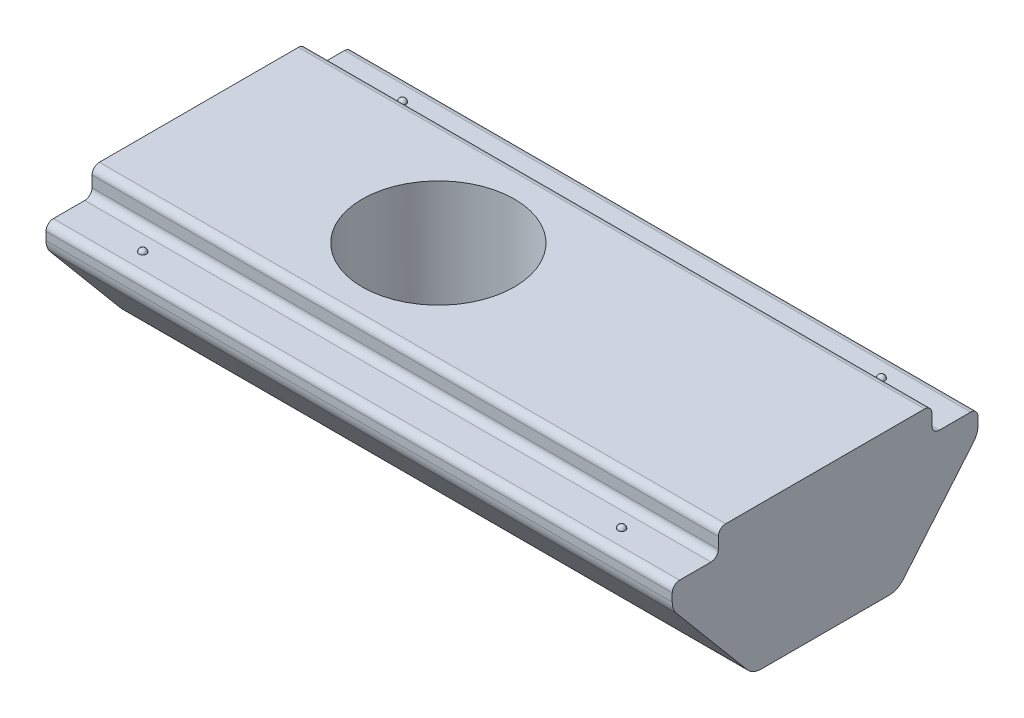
ISO-10303-21;
HEADER;
FILE_DESCRIPTION(('STEP AP214'),'2;1');
FILE_NAME('part.step','',(''),(''),'','','');
FILE_SCHEMA(('AUTOMOTIVE_DESIGN { 1 0 10303 214 1 1 1 1 }'));
ENDSEC;
DATA;
#1=APPLICATION_CONTEXT('core data for automotive mechanical design processes');
#2=APPLICATION_PROTOCOL_DEFINITION('international standard','automotive_design',2000,#1);
#3=PRODUCT_CONTEXT('',#1,'mechanical');
#4=PRODUCT('Part','Part','',(#3));
#5=PRODUCT_RELATED_PRODUCT_CATEGORY('part','',(#4));
#6=PRODUCT_DEFINITION_FORMATION('','',#4);
#7=PRODUCT_DEFINITION_CONTEXT('part definition',#1,'design');
#8=PRODUCT_DEFINITION('design','',#6,#7);
#9=PRODUCT_DEFINITION_SHAPE('','',#8);
#10=(LENGTH_UNIT() NAMED_UNIT(*) SI_UNIT(.MILLI.,.METRE.));
#11=(NAMED_UNIT(*) PLANE_ANGLE_UNIT() SI_UNIT($,.RADIAN.));
#12=(NAMED_UNIT(*) SI_UNIT($,.STERADIAN.) SOLID_ANGLE_UNIT());
#13=UNCERTAINTY_MEASURE_WITH_UNIT(LENGTH_MEASURE(1.E-05),#10,'distance_accuracy_value','');
#14=(GEOMETRIC_REPRESENTATION_CONTEXT(3) GLOBAL_UNCERTAINTY_ASSIGNED_CONTEXT((#13)) GLOBAL_UNIT_ASSIGNED_CONTEXT((#10,
#11,#12)) REPRESENTATION_CONTEXT('',''));
#15=CARTESIAN_POINT('',(0.,0.,0.));
#16=DIRECTION('',(0.,0.,1.));
#17=DIRECTION('',(1.,0.,0.));
#18=AXIS2_PLACEMENT_3D('',#15,#16,#17);
#19=CARTESIAN_POINT('',(10.5,-3.2,1.96834095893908));
#20=DIRECTION('',(0.,1.,0.));
#21=DIRECTION('',(0.,0.,1.));
#22=AXIS2_PLACEMENT_3D('',#19,#20,#21);
#23=PLANE('',#22);
#24=DIRECTION('',(-1.,0.,0.));
#25=VECTOR('',#24,1.);
#26=CARTESIAN_POINT('',(10.5,-3.2,1.73518712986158));
#27=LINE('',#26,#25);
#28=CARTESIAN_POINT('',(6.27278727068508,-3.2,1.73518712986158));
#29=VERTEX_POINT('',#28);
#30=CARTESIAN_POINT('',(1.12321619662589,-3.2,1.73518712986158));
#31=VERTEX_POINT('',#30);
#32=EDGE_CURVE('E230',#29,#31,#27,.T.);
#33=ORIENTED_EDGE('',*,*,#32,.T.);
#34=CARTESIAN_POINT('',(0.,-3.2,0.));
#35=DIRECTION('',(0.,1.,0.));
#36=DIRECTION('',(0.,0.,1.));
#37=AXIS2_PLACEMENT_3D('',#34,#35,#36);
#38=CIRCLE('',#37,2.067);
#39=CARTESIAN_POINT('',(1.12321619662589,-3.2,-1.73518712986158));
#40=VERTEX_POINT('',#39);
#41=EDGE_CURVE('E54',#31,#40,#38,.T.);
#42=ORIENTED_EDGE('',*,*,#41,.T.);
#43=DIRECTION('',(-1.,0.,0.));
#44=VECTOR('',#43,1.);
#45=CARTESIAN_POINT('',(10.5,-3.2,-1.73518712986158));
#46=LINE('',#45,#44);
#47=CARTESIAN_POINT('',(6.27278727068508,-3.2,-1.73518712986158));
#48=VERTEX_POINT('',#47);
#49=EDGE_CURVE('E78',#40,#48,#46,.F.);
#50=ORIENTED_EDGE('',*,*,#49,.T.);
#51=CARTESIAN_POINT('',(6.5,-3.2,0.));
#52=DIRECTION('',(0.,1.,0.));
#53=DIRECTION('',(0.,0.,1.));
#54=AXIS2_PLACEMENT_3D('',#51,#52,#53);
#55=CIRCLE('',#54,1.75);
#56=EDGE_CURVE('E378',#48,#29,#55,.T.);
#57=ORIENTED_EDGE('',*,*,#56,.T.);
#58=EDGE_LOOP('',(#33,#42,#50,#57));
#59=FACE_BOUND('',#58,.T.);
#60=ADVANCED_FACE('F34',(#59),#23,.F.);
#61=CARTESIAN_POINT('',(-6.5,-3.2,-1.73518712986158));
#62=VERTEX_POINT('',#61);
#63=CARTESIAN_POINT('',(-1.12321619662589,-3.2,-1.73518712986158));
#64=VERTEX_POINT('',#63);
#65=EDGE_CURVE('E234',#62,#64,#46,.F.);
#66=ORIENTED_EDGE('',*,*,#65,.T.);
#67=CARTESIAN_POINT('',(-1.12321619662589,-3.2,1.73518712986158));
#68=VERTEX_POINT('',#67);
#69=EDGE_CURVE('E400',#64,#68,#38,.T.);
#70=ORIENTED_EDGE('',*,*,#69,.T.);
#71=CARTESIAN_POINT('',(-6.5,-3.2,1.73518712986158));
#72=VERTEX_POINT('',#71);
#73=EDGE_CURVE('E232',#68,#72,#27,.T.);
#74=ORIENTED_EDGE('',*,*,#73,.T.);
#75=DIRECTION('',(0.,0.,-1.));
#76=VECTOR('',#75,1.);
#77=CARTESIAN_POINT('',(-6.5,-3.2,1.96834095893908));
#78=LINE('',#77,#76);
#79=EDGE_CURVE('E350',#72,#62,#78,.T.);
#80=ORIENTED_EDGE('',*,*,#79,.T.);
#81=EDGE_LOOP('',(#66,#70,#74,#80));
#82=FACE_BOUND('',#81,.T.);
#83=ADVANCED_FACE('F456',(#82),#23,.F.);
#84=CARTESIAN_POINT('',(6.72721272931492,-3.2,1.73518712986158));
#85=VERTEX_POINT('',#84);
#86=CARTESIAN_POINT('',(6.72721272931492,-3.2,-1.73518712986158));
#87=VERTEX_POINT('',#86);
#88=EDGE_CURVE('E63',#85,#87,#55,.T.);
#89=ORIENTED_EDGE('',*,*,#88,.T.);
#90=CARTESIAN_POINT('',(10.5,-3.2,-1.73518712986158));
#91=VERTEX_POINT('',#90);
#92=EDGE_CURVE('E226',#87,#91,#46,.F.);
#93=ORIENTED_EDGE('',*,*,#92,.T.);
#94=DIRECTION('',(0.,0.,-1.));
#95=VECTOR('',#94,1.);
#96=CARTESIAN_POINT('',(10.5,-3.2,1.96834095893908));
#97=LINE('',#96,#95);
#98=CARTESIAN_POINT('',(10.5,-3.2,1.73518712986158));
#99=VERTEX_POINT('',#98);
#100=EDGE_CURVE('E211',#99,#91,#97,.T.);
#101=ORIENTED_EDGE('',*,*,#100,.F.);
#102=EDGE_CURVE('E224',#99,#85,#27,.T.);
#103=ORIENTED_EDGE('',*,*,#102,.T.);
#104=EDGE_LOOP('',(#89,#93,#101,#103));
#105=FACE_BOUND('',#104,.T.);
#106=ADVANCED_FACE('F223',(#105),#23,.F.);
#107=CARTESIAN_POINT('',(10.5,-2.7,-1.73518712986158));
#108=DIRECTION('',(-1.,0.,0.));
#109=DIRECTION('',(0.,0.,1.));
#110=AXIS2_PLACEMENT_3D('',#107,#108,#109);
#111=CYLINDRICAL_SURFACE('',#110,0.5);
#112=CARTESIAN_POINT('',(-1.12321619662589,-3.2,-1.73518712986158));
#113=CARTESIAN_POINT('',(-1.08769534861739,-3.19997959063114,-1.75818499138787));
#114=CARTESIAN_POINT('',(-1.05150737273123,-3.19841594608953,-1.78005784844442));
#115=CARTESIAN_POINT('',(-0.978056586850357,-3.19294935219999,-1.82144547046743));
#116=CARTESIAN_POINT('',(-0.940795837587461,-3.18905063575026,-1.84096442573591));
#117=CARTESIAN_POINT('',(-0.865132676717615,-3.17963116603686,-1.87771521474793));
#118=CARTESIAN_POINT('',(-0.826725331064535,-3.17410207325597,-1.89493461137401));
#119=CARTESIAN_POINT('',(-0.749055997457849,-3.16207862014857,-1.92695879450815));
#120=CARTESIAN_POINT('',(-0.709793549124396,-3.15558372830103,-1.94176224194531));
#121=CARTESIAN_POINT('',(-0.579128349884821,-3.13361926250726,-1.98654275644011));
#122=CARTESIAN_POINT('',(-0.485988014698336,-3.1174100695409,-2.01137196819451));
#123=CARTESIAN_POINT('',(-0.344114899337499,-3.09748613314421,-2.03871928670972));
#124=CARTESIAN_POINT('',(-0.296590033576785,-3.09158617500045,-2.04617896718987));
#125=CARTESIAN_POINT('',(-0.200917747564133,-3.08209086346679,-2.05777546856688));
#126=CARTESIAN_POINT('',(-0.152770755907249,-3.07849400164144,-2.06191446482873));
#127=CARTESIAN_POINT('',(-0.0503369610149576,-3.07396696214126,-2.06709713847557));
#128=CARTESIAN_POINT('',(0.00398999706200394,-3.0734107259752,-2.06770729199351));
#129=CARTESIAN_POINT('',(0.112431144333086,-3.07610538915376,-2.06465306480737));
#130=CARTESIAN_POINT('',(0.166545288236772,-3.07935705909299,-2.06098781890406));
#131=CARTESIAN_POINT('',(0.27445295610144,-3.08898741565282,-2.04942295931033));
#132=CARTESIAN_POINT('',(0.328240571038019,-3.09539059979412,-2.04149012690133));
#133=CARTESIAN_POINT('',(0.434781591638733,-3.11010689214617,-2.02148331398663));
#134=CARTESIAN_POINT('',(0.487534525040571,-3.11842085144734,-2.00940748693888));
#135=CARTESIAN_POINT('',(0.591294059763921,-3.13551659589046,-1.98134246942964));
#136=CARTESIAN_POINT('',(0.642313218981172,-3.14429251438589,-1.96539594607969));
#137=CARTESIAN_POINT('',(0.743032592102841,-3.16109163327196,-1.9295717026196));
#138=CARTESIAN_POINT('',(0.792733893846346,-3.16911546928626,-1.90969734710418));
#139=CARTESIAN_POINT('',(0.890201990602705,-3.18305719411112,-1.86623740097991));
#140=CARTESIAN_POINT('',(0.937983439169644,-3.1889959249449,-1.8426921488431));
#141=CARTESIAN_POINT('',(1.03193471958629,-3.19744832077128,-1.79177872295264));
#142=CARTESIAN_POINT('',(1.07809968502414,-3.19995238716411,-1.76440007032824));
#143=CARTESIAN_POINT('',(1.12321619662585,-3.20000000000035,-1.73518712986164));
#144=B_SPLINE_CURVE_WITH_KNOTS('',3,(#112,#113,#114,#115,#116,#117,#118,#119,#120,#121,#122,
#123,#124,#125,#126,#127,#128,#129,#130,#131,#132,#133,#134,#135,#136,#137,#138,#139,#140,#141,
#142,#143),.UNSPECIFIED.,.F.,.F.,(4,2,2,2,2,2,2,2,2,2,2,2,2,2,2,4),(0.,0.126826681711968,
0.253424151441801,0.3806807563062,0.508007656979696,0.800068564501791,0.945343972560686,
1.09052413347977,1.25321406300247,1.41593692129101,1.57994513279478,1.74402653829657,
1.90637542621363,2.06858584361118,2.22912532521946,2.39011254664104),.UNSPECIFIED.);
#145=EDGE_CURVE('E394',#64,#40,#144,.T.);
#146=ORIENTED_EDGE('',*,*,#145,.F.);
#147=ORIENTED_EDGE('',*,*,#65,.F.);
#148=CARTESIAN_POINT('',(-6.5,-2.7,-1.73518712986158));
#149=DIRECTION('',(1.,0.,0.));
#150=DIRECTION('',(0.,0.,-1.));
#151=AXIS2_PLACEMENT_3D('',#148,#149,#150);
#152=CIRCLE('',#151,0.5);
#153=CARTESIAN_POINT('',(-6.5,-3.02139380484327,-2.11820935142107));
#154=VERTEX_POINT('',#153);
#155=EDGE_CURVE('E267',#154,#62,#152,.F.);
#156=ORIENTED_EDGE('',*,*,#155,.F.);
#157=DIRECTION('',(-1.,0.,0.));
#158=VECTOR('',#157,1.);
#159=CARTESIAN_POINT('',(10.5,-3.02139380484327,-2.11820935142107));
#160=LINE('',#159,#158);
#161=CARTESIAN_POINT('',(10.5,-3.02139380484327,-2.11820935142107));
#162=VERTEX_POINT('',#161);
#163=EDGE_CURVE('E260',#162,#154,#160,.T.);
#164=ORIENTED_EDGE('',*,*,#163,.F.);
#165=CARTESIAN_POINT('',(10.5,-2.7,-1.73518712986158));
#166=DIRECTION('',(1.,0.,0.));
#167=DIRECTION('',(0.,0.,-1.));
#168=AXIS2_PLACEMENT_3D('',#165,#166,#167);
#169=CIRCLE('',#168,0.5);
#170=EDGE_CURVE('E218',#91,#162,#169,.T.);
#171=ORIENTED_EDGE('',*,*,#170,.F.);
#172=ORIENTED_EDGE('',*,*,#92,.F.);
#173=CARTESIAN_POINT('',(6.72721272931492,-3.2,-1.73518712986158));
#174=CARTESIAN_POINT('',(6.68947863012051,-3.19998176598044,-1.74012995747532));
#175=CARTESIAN_POINT('',(6.65158311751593,-3.19992670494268,-1.74383840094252));
#176=CARTESIAN_POINT('',(6.57579128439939,-3.19982610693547,-1.7487682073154));
#177=CARTESIAN_POINT('',(6.53789564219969,-3.19978053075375,-1.75));
#178=CARTESIAN_POINT('',(6.46210435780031,-3.19978053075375,-1.75));
#179=CARTESIAN_POINT('',(6.42420871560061,-3.19982610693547,-1.7487682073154));
#180=CARTESIAN_POINT('',(6.34841688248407,-3.19992670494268,-1.74383840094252));
#181=CARTESIAN_POINT('',(6.31052136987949,-3.19998176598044,-1.74012995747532));
#182=CARTESIAN_POINT('',(6.27278727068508,-3.2,-1.73518712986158));
#183=B_SPLINE_CURVE_WITH_KNOTS('',3,(#173,#174,#175,#176,#177,#178,#179,#180,#181,#182),
.UNSPECIFIED.,.F.,.F.,(4,2,2,2,4),(0.,0.114148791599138,0.227815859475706,0.341482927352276,
0.455631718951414),.UNSPECIFIED.);
#184=EDGE_CURVE('E357',#87,#48,#183,.T.);
#185=ORIENTED_EDGE('',*,*,#184,.T.);
#186=ORIENTED_EDGE('',*,*,#49,.F.);
#187=EDGE_LOOP('',(#146,#147,#156,#164,#171,#172,#185,#186));
#188=FACE_BOUND('',#187,.T.);
#189=ADVANCED_FACE('F402',(#188),#111,.T.);
#190=CARTESIAN_POINT('',(10.5,-2.7,1.73518712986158));
#191=DIRECTION('',(-1.,0.,0.));
#192=DIRECTION('',(0.,0.,1.));
#193=AXIS2_PLACEMENT_3D('',#190,#191,#192);
#194=CYLINDRICAL_SURFACE('',#193,0.5);
#195=CARTESIAN_POINT('',(1.12321619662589,-3.2,1.73518712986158));
#196=CARTESIAN_POINT('',(1.08769534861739,-3.19997959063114,1.75818499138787));
#197=CARTESIAN_POINT('',(1.05150737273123,-3.19841594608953,1.78005784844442));
#198=CARTESIAN_POINT('',(0.978056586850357,-3.19294935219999,1.82144547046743));
#199=CARTESIAN_POINT('',(0.94079583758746,-3.18905063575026,1.84096442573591));
#200=CARTESIAN_POINT('',(0.865132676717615,-3.17963116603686,1.87771521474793));
#201=CARTESIAN_POINT('',(0.826725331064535,-3.17410207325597,1.89493461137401));
#202=CARTESIAN_POINT('',(0.749055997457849,-3.16207862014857,1.92695879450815));
#203=CARTESIAN_POINT('',(0.709793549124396,-3.15558372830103,1.94176224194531));
#204=CARTESIAN_POINT('',(0.57912834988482,-3.13361926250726,1.98654275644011));
#205=CARTESIAN_POINT('',(0.485988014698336,-3.1174100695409,2.01137196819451));
#206=CARTESIAN_POINT('',(0.344114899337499,-3.09748613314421,2.03871928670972));
#207=CARTESIAN_POINT('',(0.296590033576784,-3.09158617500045,2.04617896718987));
#208=CARTESIAN_POINT('',(0.200917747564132,-3.08209086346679,2.05777546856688));
#209=CARTESIAN_POINT('',(0.152770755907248,-3.07849400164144,2.06191446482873));
#210=CARTESIAN_POINT('',(0.0503369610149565,-3.07396696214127,2.06709713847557));
#211=CARTESIAN_POINT('',(-0.00398999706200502,-3.0734107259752,2.06770729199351));
#212=CARTESIAN_POINT('',(-0.112431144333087,-3.07610538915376,2.06465306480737));
#213=CARTESIAN_POINT('',(-0.166545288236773,-3.07935705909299,2.06098781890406));
#214=CARTESIAN_POINT('',(-0.274452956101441,-3.08898741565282,2.04942295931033));
#215=CARTESIAN_POINT('',(-0.32824057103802,-3.09539059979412,2.04149012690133));
#216=CARTESIAN_POINT('',(-0.434781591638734,-3.11010689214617,2.02148331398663));
#217=CARTESIAN_POINT('',(-0.487534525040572,-3.11842085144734,2.00940748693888));
#218=CARTESIAN_POINT('',(-0.591294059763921,-3.13551659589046,1.98134246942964));
#219=CARTESIAN_POINT('',(-0.642313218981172,-3.14429251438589,1.96539594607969));
#220=CARTESIAN_POINT('',(-0.743032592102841,-3.16109163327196,1.9295717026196));
#221=CARTESIAN_POINT('',(-0.792733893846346,-3.16911546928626,1.90969734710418));
#222=CARTESIAN_POINT('',(-0.890201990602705,-3.18305719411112,1.86623740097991));
#223=CARTESIAN_POINT('',(-0.937983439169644,-3.1889959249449,1.8426921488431));
#224=CARTESIAN_POINT('',(-1.03193471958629,-3.19744832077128,1.79177872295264));
#225=CARTESIAN_POINT('',(-1.07809968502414,-3.19995238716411,1.76440007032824));
#226=CARTESIAN_POINT('',(-1.12321619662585,-3.20000000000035,1.73518712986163));
#227=B_SPLINE_CURVE_WITH_KNOTS('',3,(#195,#196,#197,#198,#199,#200,#201,#202,#203,#204,#205,
#206,#207,#208,#209,#210,#211,#212,#213,#214,#215,#216,#217,#218,#219,#220,#221,#222,#223,#224,
#225,#226),.UNSPECIFIED.,.F.,.F.,(4,2,2,2,2,2,2,2,2,2,2,2,2,2,2,4),(0.,0.126826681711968,
0.253424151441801,0.3806807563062,0.508007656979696,0.800068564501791,0.945343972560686,
1.09052413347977,1.25321406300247,1.41593692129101,1.57994513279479,1.74402653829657,
1.90637542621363,2.06858584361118,2.22912532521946,2.39011254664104),.UNSPECIFIED.);
#228=EDGE_CURVE('E11',#31,#68,#227,.T.);
#229=ORIENTED_EDGE('',*,*,#228,.F.);
#230=ORIENTED_EDGE('',*,*,#32,.F.);
#231=CARTESIAN_POINT('',(6.27278727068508,-3.2,1.73518712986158));
#232=CARTESIAN_POINT('',(6.31052136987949,-3.19998176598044,1.74012995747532));
#233=CARTESIAN_POINT('',(6.34841688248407,-3.19992670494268,1.74383840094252));
#234=CARTESIAN_POINT('',(6.42420871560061,-3.19982610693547,1.7487682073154));
#235=CARTESIAN_POINT('',(6.46210435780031,-3.19978053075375,1.75));
#236=CARTESIAN_POINT('',(6.53789564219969,-3.19978053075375,1.75));
#237=CARTESIAN_POINT('',(6.57579128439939,-3.19982610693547,1.7487682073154));
#238=CARTESIAN_POINT('',(6.65158311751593,-3.19992670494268,1.74383840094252));
#239=CARTESIAN_POINT('',(6.68947863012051,-3.19998176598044,1.74012995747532));
#240=CARTESIAN_POINT('',(6.72721272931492,-3.2,1.73518712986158));
#241=B_SPLINE_CURVE_WITH_KNOTS('',3,(#231,#232,#233,#234,#235,#236,#237,#238,#239,#240),
.UNSPECIFIED.,.F.,.F.,(4,2,2,2,4),(0.,0.11414879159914,0.227815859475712,0.341482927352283,
0.455631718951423),.UNSPECIFIED.);
#242=EDGE_CURVE('E48',#29,#85,#241,.T.);
#243=ORIENTED_EDGE('',*,*,#242,.T.);
#244=ORIENTED_EDGE('',*,*,#102,.F.);
#245=CARTESIAN_POINT('',(10.5,-2.7,1.73518712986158));
#246=DIRECTION('',(1.,0.,0.));
#247=DIRECTION('',(0.,0.,-1.));
#248=AXIS2_PLACEMENT_3D('',#245,#246,#247);
#249=CIRCLE('',#248,0.5);
#250=CARTESIAN_POINT('',(10.5,-3.02139380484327,2.11820935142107));
#251=VERTEX_POINT('',#250);
#252=EDGE_CURVE('E207',#251,#99,#249,.T.);
#253=ORIENTED_EDGE('',*,*,#252,.F.);
#254=DIRECTION('',(-1.,0.,0.));
#255=VECTOR('',#254,1.);
#256=CARTESIAN_POINT('',(10.5,-3.02139380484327,2.11820935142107));
#257=LINE('',#256,#255);
#258=CARTESIAN_POINT('',(-6.5,-3.02139380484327,2.11820935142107));
#259=VERTEX_POINT('',#258);
#260=EDGE_CURVE('E250',#259,#251,#257,.F.);
#261=ORIENTED_EDGE('',*,*,#260,.F.);
#262=CARTESIAN_POINT('',(-6.5,-2.7,1.73518712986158));
#263=DIRECTION('',(1.,0.,0.));
#264=DIRECTION('',(0.,0.,-1.));
#265=AXIS2_PLACEMENT_3D('',#262,#263,#264);
#266=CIRCLE('',#265,0.5);
#267=EDGE_CURVE('E269',#72,#259,#266,.F.);
#268=ORIENTED_EDGE('',*,*,#267,.F.);
#269=ORIENTED_EDGE('',*,*,#73,.F.);
#270=EDGE_LOOP('',(#229,#230,#243,#244,#253,#261,#268,#269));
#271=FACE_BOUND('',#270,.T.);
#272=ADVANCED_FACE('F36',(#271),#194,.T.);
#273=CARTESIAN_POINT('',(10.5,0.,4.15));
#274=DIRECTION('',(0.,0.,-1.));
#275=DIRECTION('',(-1.,0.,0.));
#276=AXIS2_PLACEMENT_3D('',#273,#274,#275);
#277=PLANE('',#276);
#278=DIRECTION('',(0.,-1.,0.));
#279=VECTOR('',#278,1.);
#280=CARTESIAN_POINT('',(-6.5,0.,4.15));
#281=LINE('',#280,#279);
#282=CARTESIAN_POINT('',(-6.5,-0.200000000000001,4.15));
#283=VERTEX_POINT('',#282);
#284=CARTESIAN_POINT('',(-6.5,-0.4180148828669,4.15));
#285=VERTEX_POINT('',#284);
#286=EDGE_CURVE('E355',#283,#285,#281,.T.);
#287=ORIENTED_EDGE('',*,*,#286,.T.);
#288=DIRECTION('',(-1.,0.,0.));
#289=VECTOR('',#288,1.);
#290=CARTESIAN_POINT('',(10.5,-0.4180148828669,4.15));
#291=LINE('',#290,#289);
#292=CARTESIAN_POINT('',(10.5,-0.4180148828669,4.15));
#293=VERTEX_POINT('',#292);
#294=EDGE_CURVE('E237',#285,#293,#291,.F.);
#295=ORIENTED_EDGE('',*,*,#294,.T.);
#296=DIRECTION('',(0.,-1.,0.));
#297=VECTOR('',#296,1.);
#298=CARTESIAN_POINT('',(10.5,0.,4.15));
#299=LINE('',#298,#297);
#300=CARTESIAN_POINT('',(10.5,-0.200000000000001,4.15));
#301=VERTEX_POINT('',#300);
#302=EDGE_CURVE('E332',#301,#293,#299,.T.);
#303=ORIENTED_EDGE('',*,*,#302,.F.);
#304=DIRECTION('',(-1.,0.,0.));
#305=VECTOR('',#304,1.);
#306=CARTESIAN_POINT('',(10.5,-0.200000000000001,4.15));
#307=LINE('',#306,#305);
#308=EDGE_CURVE('E282',#301,#283,#307,.T.);
#309=ORIENTED_EDGE('',*,*,#308,.T.);
#310=EDGE_LOOP('',(#287,#295,#303,#309));
#311=FACE_BOUND('',#310,.T.);
#312=ADVANCED_FACE('F515',(#311),#277,.F.);
#313=CARTESIAN_POINT('',(10.5,-0.600000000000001,4.15));
#314=DIRECTION('',(0.,0.642787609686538,-0.766044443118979));
#315=DIRECTION('',(0.,0.766044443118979,0.642787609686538));
#316=AXIS2_PLACEMENT_3D('',#313,#314,#315);
#317=PLANE('',#316);
#318=DIRECTION('',(0.,-0.766044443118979,-0.642787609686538));
#319=VECTOR('',#318,1.);
#320=CARTESIAN_POINT('',(10.5,-0.600000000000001,4.15));
#321=LINE('',#320,#319);
#322=CARTESIAN_POINT('',(10.5,-0.739408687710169,4.03302222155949));
#323=VERTEX_POINT('',#322);
#324=EDGE_CURVE('E214',#323,#251,#321,.T.);
#325=ORIENTED_EDGE('',*,*,#324,.F.);
#326=DIRECTION('',(-1.,0.,0.));
#327=VECTOR('',#326,1.);
#328=CARTESIAN_POINT('',(10.5,-0.739408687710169,4.03302222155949));
#329=LINE('',#328,#327);
#330=CARTESIAN_POINT('',(-6.5,-0.739408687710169,4.03302222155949));
#331=VERTEX_POINT('',#330);
#332=EDGE_CURVE('E243',#323,#331,#329,.T.);
#333=ORIENTED_EDGE('',*,*,#332,.T.);
#334=DIRECTION('',(0.,-0.766044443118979,-0.642787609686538));
#335=VECTOR('',#334,1.);
#336=CARTESIAN_POINT('',(-6.5,-0.600000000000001,4.15));
#337=LINE('',#336,#335);
#338=EDGE_CURVE('E352',#331,#259,#337,.T.);
#339=ORIENTED_EDGE('',*,*,#338,.T.);
#340=ORIENTED_EDGE('',*,*,#260,.T.);
#341=EDGE_LOOP('',(#325,#333,#339,#340));
#342=FACE_BOUND('',#341,.T.);
#343=ADVANCED_FACE('F510',(#342),#317,.F.);
#344=CARTESIAN_POINT('',(10.5,-3.2,-1.96834095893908));
#345=DIRECTION('',(0.,0.642787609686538,0.766044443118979));
#346=DIRECTION('',(0.,-0.766044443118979,0.642787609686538));
#347=AXIS2_PLACEMENT_3D('',#344,#345,#346);
#348=PLANE('',#347);
#349=DIRECTION('',(0.,0.766044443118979,-0.642787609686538));
#350=VECTOR('',#349,1.);
#351=CARTESIAN_POINT('',(-6.5,-3.2,-1.96834095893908));
#352=LINE('',#351,#350);
#353=CARTESIAN_POINT('',(-6.5,-0.739408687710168,-4.03302222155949));
#354=VERTEX_POINT('',#353);
#355=EDGE_CURVE('E347',#154,#354,#352,.T.);
#356=ORIENTED_EDGE('',*,*,#355,.T.);
#357=DIRECTION('',(-1.,0.,0.));
#358=VECTOR('',#357,1.);
#359=CARTESIAN_POINT('',(10.5,-0.739408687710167,-4.03302222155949));
#360=LINE('',#359,#358);
#361=CARTESIAN_POINT('',(10.5,-0.739408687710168,-4.03302222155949));
#362=VERTEX_POINT('',#361);
#363=EDGE_CURVE('E219',#354,#362,#360,.F.);
#364=ORIENTED_EDGE('',*,*,#363,.T.);
#365=DIRECTION('',(0.,0.766044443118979,-0.642787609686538));
#366=VECTOR('',#365,1.);
#367=CARTESIAN_POINT('',(10.5,-3.2,-1.96834095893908));
#368=LINE('',#367,#366);
#369=EDGE_CURVE('E227',#162,#362,#368,.T.);
#370=ORIENTED_EDGE('',*,*,#369,.F.);
#371=ORIENTED_EDGE('',*,*,#163,.T.);
#372=EDGE_LOOP('',(#356,#364,#370,#371));
#373=FACE_BOUND('',#372,.T.);
#374=ADVANCED_FACE('F505',(#373),#348,.F.);
#375=CARTESIAN_POINT('',(10.5,-0.6,-4.15));
#376=DIRECTION('',(0.,0.,1.));
#377=DIRECTION('',(1.,0.,0.));
#378=AXIS2_PLACEMENT_3D('',#375,#376,#377);
#379=PLANE('',#378);
#380=DIRECTION('',(0.,1.,0.));
#381=VECTOR('',#380,1.);
#382=CARTESIAN_POINT('',(10.5,-0.6,-4.15));
#383=LINE('',#382,#381);
#384=CARTESIAN_POINT('',(10.5,-0.418014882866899,-4.15));
#385=VERTEX_POINT('',#384);
#386=CARTESIAN_POINT('',(10.5,-0.2,-4.15));
#387=VERTEX_POINT('',#386);
#388=EDGE_CURVE('E372',#385,#387,#383,.T.);
#389=ORIENTED_EDGE('',*,*,#388,.F.);
#390=DIRECTION('',(-1.,0.,0.));
#391=VECTOR('',#390,1.);
#392=CARTESIAN_POINT('',(10.5,-0.418014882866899,-4.15));
#393=LINE('',#392,#391);
#394=CARTESIAN_POINT('',(-6.5,-0.418014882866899,-4.15));
#395=VERTEX_POINT('',#394);
#396=EDGE_CURVE('E271',#385,#395,#393,.T.);
#397=ORIENTED_EDGE('',*,*,#396,.T.);
#398=DIRECTION('',(0.,1.,0.));
#399=VECTOR('',#398,1.);
#400=CARTESIAN_POINT('',(-6.5,-0.6,-4.15));
#401=LINE('',#400,#399);
#402=CARTESIAN_POINT('',(-6.5,-0.2,-4.15));
#403=VERTEX_POINT('',#402);
#404=EDGE_CURVE('E345',#395,#403,#401,.T.);
#405=ORIENTED_EDGE('',*,*,#404,.T.);
#406=DIRECTION('',(-1.,0.,0.));
#407=VECTOR('',#406,1.);
#408=CARTESIAN_POINT('',(10.5,-0.2,-4.15));
#409=LINE('',#408,#407);
#410=EDGE_CURVE('E285',#403,#387,#409,.F.);
#411=ORIENTED_EDGE('',*,*,#410,.T.);
#412=EDGE_LOOP('',(#389,#397,#405,#411));
#413=FACE_BOUND('',#412,.T.);
#414=ADVANCED_FACE('F497',(#413),#379,.F.);
#415=CARTESIAN_POINT('',(10.5,0.,-4.15));
#416=DIRECTION('',(0.,-1.,0.));
#417=DIRECTION('',(0.,0.,-1.));
#418=AXIS2_PLACEMENT_3D('',#415,#416,#417);
#419=PLANE('',#418);
#420=CARTESIAN_POINT('',(8.5,0.,-3.525));
#421=DIRECTION('',(0.,1.,0.));
#422=DIRECTION('',(0.,0.,1.));
#423=AXIS2_PLACEMENT_3D('',#420,#421,#422);
#424=CIRCLE('',#423,0.0999999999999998);
#425=CARTESIAN_POINT('',(8.5,0.,-3.425));
#426=VERTEX_POINT('',#425);
#427=EDGE_CURVE('E391',#426,#426,#424,.T.);
#428=ORIENTED_EDGE('',*,*,#427,.F.);
#429=EDGE_LOOP('',(#428));
#430=FACE_BOUND('',#429,.T.);
#431=CARTESIAN_POINT('',(-4.5,0.,-3.525));
#432=DIRECTION('',(0.,1.,0.));
#433=DIRECTION('',(0.,0.,1.));
#434=AXIS2_PLACEMENT_3D('',#431,#432,#433);
#435=CIRCLE('',#434,0.0999999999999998);
#436=CARTESIAN_POINT('',(-4.5,0.,-3.425));
#437=VERTEX_POINT('',#436);
#438=EDGE_CURVE('E388',#437,#437,#435,.T.);
#439=ORIENTED_EDGE('',*,*,#438,.F.);
#440=EDGE_LOOP('',(#439));
#441=FACE_BOUND('',#440,.T.);
#442=DIRECTION('',(0.,0.,1.));
#443=VECTOR('',#442,1.);
#444=CARTESIAN_POINT('',(-6.5,0.,-4.15));
#445=LINE('',#444,#443);
#446=CARTESIAN_POINT('',(-6.5,0.,-3.95));
#447=VERTEX_POINT('',#446);
#448=CARTESIAN_POINT('',(-6.5,0.,-3.1));
#449=VERTEX_POINT('',#448);
#450=EDGE_CURVE('E342',#447,#449,#445,.T.);
#451=ORIENTED_EDGE('',*,*,#450,.T.);
#452=DIRECTION('',(-1.,0.,0.));
#453=VECTOR('',#452,1.);
#454=CARTESIAN_POINT('',(10.5,0.,-3.1));
#455=LINE('',#454,#453);
#456=CARTESIAN_POINT('',(10.5,0.,-3.1));
#457=VERTEX_POINT('',#456);
#458=EDGE_CURVE('E293',#449,#457,#455,.F.);
#459=ORIENTED_EDGE('',*,*,#458,.T.);
#460=DIRECTION('',(0.,0.,1.));
#461=VECTOR('',#460,1.);
#462=CARTESIAN_POINT('',(10.5,0.,-4.15));
#463=LINE('',#462,#461);
#464=CARTESIAN_POINT('',(10.5,0.,-3.95));
#465=VERTEX_POINT('',#464);
#466=EDGE_CURVE('E369',#465,#457,#463,.T.);
#467=ORIENTED_EDGE('',*,*,#466,.F.);
#468=DIRECTION('',(-1.,0.,0.));
#469=VECTOR('',#468,1.);
#470=CARTESIAN_POINT('',(10.5,0.,-3.95));
#471=LINE('',#470,#469);
#472=EDGE_CURVE('E295',#465,#447,#471,.T.);
#473=ORIENTED_EDGE('',*,*,#472,.T.);
#474=EDGE_LOOP('',(#451,#459,#467,#473));
#475=FACE_BOUND('',#474,.T.);
#476=ADVANCED_FACE('F487',(#430,#441,#475),#419,.F.);
#477=CARTESIAN_POINT('',(10.5,0.,-2.9));
#478=DIRECTION('',(0.,0.,1.));
#479=DIRECTION('',(0.,-1.,0.));
#480=AXIS2_PLACEMENT_3D('',#477,#478,#479);
#481=PLANE('',#480);
#482=DIRECTION('',(0.,1.,0.));
#483=VECTOR('',#482,1.);
#484=CARTESIAN_POINT('',(-6.5,0.,-2.9));
#485=LINE('',#484,#483);
#486=CARTESIAN_POINT('',(-6.5,0.2,-2.9));
#487=VERTEX_POINT('',#486);
#488=CARTESIAN_POINT('',(-6.5,0.499999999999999,-2.9));
#489=VERTEX_POINT('',#488);
#490=EDGE_CURVE('E339',#487,#489,#485,.T.);
#491=ORIENTED_EDGE('',*,*,#490,.T.);
#492=DIRECTION('',(-1.,0.,0.));
#493=VECTOR('',#492,1.);
#494=CARTESIAN_POINT('',(10.5,0.499999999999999,-2.9));
#495=LINE('',#494,#493);
#496=CARTESIAN_POINT('',(10.5,0.499999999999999,-2.9));
#497=VERTEX_POINT('',#496);
#498=EDGE_CURVE('E311',#489,#497,#495,.F.);
#499=ORIENTED_EDGE('',*,*,#498,.T.);
#500=DIRECTION('',(0.,1.,0.));
#501=VECTOR('',#500,1.);
#502=CARTESIAN_POINT('',(10.5,0.,-2.9));
#503=LINE('',#502,#501);
#504=CARTESIAN_POINT('',(10.5,0.2,-2.9));
#505=VERTEX_POINT('',#504);
#506=EDGE_CURVE('E366',#505,#497,#503,.T.);
#507=ORIENTED_EDGE('',*,*,#506,.F.);
#508=DIRECTION('',(-1.,0.,0.));
#509=VECTOR('',#508,1.);
#510=CARTESIAN_POINT('',(-6.5,0.2,-2.9));
#511=LINE('',#510,#509);
#512=EDGE_CURVE('E313',#505,#487,#511,.T.);
#513=ORIENTED_EDGE('',*,*,#512,.T.);
#514=EDGE_LOOP('',(#491,#499,#507,#513));
#515=FACE_BOUND('',#514,.T.);
#516=ADVANCED_FACE('F466',(#515),#481,.F.);
#517=CARTESIAN_POINT('',(10.5,0.699999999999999,-2.9));
#518=DIRECTION('',(0.,-1.,0.));
#519=DIRECTION('',(0.,0.,-1.));
#520=AXIS2_PLACEMENT_3D('',#517,#518,#519);
#521=PLANE('',#520);
#522=CARTESIAN_POINT('',(0.,0.699999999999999,0.));
#523=DIRECTION('',(0.,1.,0.));
#524=DIRECTION('',(0.,0.,1.));
#525=AXIS2_PLACEMENT_3D('',#522,#523,#524);
#526=CIRCLE('',#525,2.067);
#527=CARTESIAN_POINT('',(0.,0.699999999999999,2.067));
#528=VERTEX_POINT('',#527);
#529=EDGE_CURVE('E458',#528,#528,#526,.T.);
#530=ORIENTED_EDGE('',*,*,#529,.F.);
#531=EDGE_LOOP('',(#530));
#532=FACE_BOUND('',#531,.T.);
#533=DIRECTION('',(0.,0.,1.));
#534=VECTOR('',#533,1.);
#535=CARTESIAN_POINT('',(10.5,0.699999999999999,-2.9));
#536=LINE('',#535,#534);
#537=CARTESIAN_POINT('',(10.5,0.699999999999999,-2.7));
#538=VERTEX_POINT('',#537);
#539=CARTESIAN_POINT('',(10.5,0.699999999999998,2.7));
#540=VERTEX_POINT('',#539);
#541=EDGE_CURVE('E363',#538,#540,#536,.T.);
#542=ORIENTED_EDGE('',*,*,#541,.F.);
#543=DIRECTION('',(-1.,0.,0.));
#544=VECTOR('',#543,1.);
#545=CARTESIAN_POINT('',(10.5,0.699999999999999,-2.7));
#546=LINE('',#545,#544);
#547=CARTESIAN_POINT('',(-6.5,0.699999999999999,-2.7));
#548=VERTEX_POINT('',#547);
#549=EDGE_CURVE('E324',#538,#548,#546,.T.);
#550=ORIENTED_EDGE('',*,*,#549,.T.);
#551=DIRECTION('',(0.,0.,1.));
#552=VECTOR('',#551,1.);
#553=CARTESIAN_POINT('',(-6.5,0.699999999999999,-2.9));
#554=LINE('',#553,#552);
#555=CARTESIAN_POINT('',(-6.5,0.699999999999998,2.7));
#556=VERTEX_POINT('',#555);
#557=EDGE_CURVE('E336',#548,#556,#554,.T.);
#558=ORIENTED_EDGE('',*,*,#557,.T.);
#559=DIRECTION('',(-1.,0.,0.));
#560=VECTOR('',#559,1.);
#561=CARTESIAN_POINT('',(10.5,0.699999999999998,2.7));
#562=LINE('',#561,#560);
#563=EDGE_CURVE('E326',#556,#540,#562,.F.);
#564=ORIENTED_EDGE('',*,*,#563,.T.);
#565=EDGE_LOOP('',(#542,#550,#558,#564));
#566=FACE_BOUND('',#565,.T.);
#567=ADVANCED_FACE('F462',(#532,#566),#521,.F.);
#568=CARTESIAN_POINT('',(10.5,0.699999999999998,2.9));
#569=DIRECTION('',(0.,0.,-1.));
#570=DIRECTION('',(0.,1.,0.));
#571=AXIS2_PLACEMENT_3D('',#568,#569,#570);
#572=PLANE('',#571);
#573=DIRECTION('',(0.,-1.,0.));
#574=VECTOR('',#573,1.);
#575=CARTESIAN_POINT('',(10.5,0.699999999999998,2.9));
#576=LINE('',#575,#574);
#577=CARTESIAN_POINT('',(10.5,0.499999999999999,2.9));
#578=VERTEX_POINT('',#577);
#579=CARTESIAN_POINT('',(10.5,0.199999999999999,2.9));
#580=VERTEX_POINT('',#579);
#581=EDGE_CURVE('E360',#578,#580,#576,.T.);
#582=ORIENTED_EDGE('',*,*,#581,.F.);
#583=DIRECTION('',(-1.,0.,0.));
#584=VECTOR('',#583,1.);
#585=CARTESIAN_POINT('',(10.5,0.499999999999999,2.9));
#586=LINE('',#585,#584);
#587=CARTESIAN_POINT('',(-6.5,0.499999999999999,2.9));
#588=VERTEX_POINT('',#587);
#589=EDGE_CURVE('E298',#578,#588,#586,.T.);
#590=ORIENTED_EDGE('',*,*,#589,.T.);
#591=DIRECTION('',(0.,-1.,0.));
#592=VECTOR('',#591,1.);
#593=CARTESIAN_POINT('',(-6.5,0.699999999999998,2.9));
#594=LINE('',#593,#592);
#595=CARTESIAN_POINT('',(-6.5,0.199999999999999,2.9));
#596=VERTEX_POINT('',#595);
#597=EDGE_CURVE('E333',#588,#596,#594,.T.);
#598=ORIENTED_EDGE('',*,*,#597,.T.);
#599=DIRECTION('',(-1.,0.,0.));
#600=VECTOR('',#599,1.);
#601=CARTESIAN_POINT('',(10.5,0.199999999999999,2.9));
#602=LINE('',#601,#600);
#603=EDGE_CURVE('E301',#596,#580,#602,.F.);
#604=ORIENTED_EDGE('',*,*,#603,.T.);
#605=EDGE_LOOP('',(#582,#590,#598,#604));
#606=FACE_BOUND('',#605,.T.);
#607=ADVANCED_FACE('F465',(#606),#572,.F.);
#608=CARTESIAN_POINT('',(10.5,0.,2.9));
#609=DIRECTION('',(0.,-1.,0.));
#610=DIRECTION('',(0.,0.,-1.));
#611=AXIS2_PLACEMENT_3D('',#608,#609,#610);
#612=PLANE('',#611);
#613=CARTESIAN_POINT('',(8.5,0.,3.525));
#614=DIRECTION('',(0.,1.,0.));
#615=DIRECTION('',(0.,0.,1.));
#616=AXIS2_PLACEMENT_3D('',#613,#614,#615);
#617=CIRCLE('',#616,0.0999999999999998);
#618=CARTESIAN_POINT('',(8.5,0.,3.625));
#619=VERTEX_POINT('',#618);
#620=EDGE_CURVE('E385',#619,#619,#617,.T.);
#621=ORIENTED_EDGE('',*,*,#620,.F.);
#622=EDGE_LOOP('',(#621));
#623=FACE_BOUND('',#622,.T.);
#624=CARTESIAN_POINT('',(-4.5,0.,3.525));
#625=DIRECTION('',(0.,1.,0.));
#626=DIRECTION('',(0.,0.,1.));
#627=AXIS2_PLACEMENT_3D('',#624,#625,#626);
#628=CIRCLE('',#627,0.0999999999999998);
#629=CARTESIAN_POINT('',(-4.5,0.,3.625));
#630=VERTEX_POINT('',#629);
#631=EDGE_CURVE('E382',#630,#630,#628,.T.);
#632=ORIENTED_EDGE('',*,*,#631,.F.);
#633=EDGE_LOOP('',(#632));
#634=FACE_BOUND('',#633,.T.);
#635=DIRECTION('',(0.,0.,1.));
#636=VECTOR('',#635,1.);
#637=CARTESIAN_POINT('',(10.5,0.,2.9));
#638=LINE('',#637,#636);
#639=CARTESIAN_POINT('',(10.5,0.,3.1));
#640=VERTEX_POINT('',#639);
#641=CARTESIAN_POINT('',(10.5,0.,3.95));
#642=VERTEX_POINT('',#641);
#643=EDGE_CURVE('E328',#640,#642,#638,.T.);
#644=ORIENTED_EDGE('',*,*,#643,.F.);
#645=DIRECTION('',(-1.,0.,0.));
#646=VECTOR('',#645,1.);
#647=CARTESIAN_POINT('',(-6.5,0.,3.1));
#648=LINE('',#647,#646);
#649=CARTESIAN_POINT('',(-6.5,0.,3.1));
#650=VERTEX_POINT('',#649);
#651=EDGE_CURVE('E288',#640,#650,#648,.T.);
#652=ORIENTED_EDGE('',*,*,#651,.T.);
#653=DIRECTION('',(0.,0.,1.));
#654=VECTOR('',#653,1.);
#655=CARTESIAN_POINT('',(-6.5,0.,2.9));
#656=LINE('',#655,#654);
#657=CARTESIAN_POINT('',(-6.5,0.,3.95));
#658=VERTEX_POINT('',#657);
#659=EDGE_CURVE('E329',#650,#658,#656,.T.);
#660=ORIENTED_EDGE('',*,*,#659,.T.);
#661=DIRECTION('',(-1.,0.,0.));
#662=VECTOR('',#661,1.);
#663=CARTESIAN_POINT('',(10.5,0.,3.95));
#664=LINE('',#663,#662);
#665=EDGE_CURVE('E291',#658,#642,#664,.F.);
#666=ORIENTED_EDGE('',*,*,#665,.T.);
#667=EDGE_LOOP('',(#644,#652,#660,#666));
#668=FACE_BOUND('',#667,.T.);
#669=ADVANCED_FACE('F524',(#623,#634,#668),#612,.F.);
#670=CARTESIAN_POINT('',(10.5,0.,0.));
#671=DIRECTION('',(1.,0.,0.));
#672=DIRECTION('',(0.,0.,-1.));
#673=AXIS2_PLACEMENT_3D('',#670,#671,#672);
#674=PLANE('',#673);
#675=ORIENTED_EDGE('',*,*,#369,.T.);
#676=CARTESIAN_POINT('',(10.5,-0.418014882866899,-3.65));
#677=DIRECTION('',(1.,0.,0.));
#678=DIRECTION('',(0.,0.,-1.));
#679=AXIS2_PLACEMENT_3D('',#676,#677,#678);
#680=CIRCLE('',#679,0.5);
#681=EDGE_CURVE('E254',#362,#385,#680,.T.);
#682=ORIENTED_EDGE('',*,*,#681,.T.);
#683=ORIENTED_EDGE('',*,*,#388,.T.);
#684=CARTESIAN_POINT('',(10.5,-0.2,-3.95));
#685=DIRECTION('',(1.,0.,0.));
#686=DIRECTION('',(0.,0.,-1.));
#687=AXIS2_PLACEMENT_3D('',#684,#685,#686);
#688=CIRCLE('',#687,0.2);
#689=EDGE_CURVE('E307',#387,#465,#688,.T.);
#690=ORIENTED_EDGE('',*,*,#689,.T.);
#691=ORIENTED_EDGE('',*,*,#466,.T.);
#692=CARTESIAN_POINT('',(10.5,0.2,-3.1));
#693=DIRECTION('',(1.,0.,0.));
#694=DIRECTION('',(0.,0.,-1.));
#695=AXIS2_PLACEMENT_3D('',#692,#693,#694);
#696=CIRCLE('',#695,0.2);
#697=EDGE_CURVE('E278',#457,#505,#696,.F.);
#698=ORIENTED_EDGE('',*,*,#697,.T.);
#699=ORIENTED_EDGE('',*,*,#506,.T.);
#700=CARTESIAN_POINT('',(10.5,0.499999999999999,-2.7));
#701=DIRECTION('',(1.,0.,0.));
#702=DIRECTION('',(0.,0.,-1.));
#703=AXIS2_PLACEMENT_3D('',#700,#701,#702);
#704=CIRCLE('',#703,0.2);
#705=EDGE_CURVE('E303',#497,#538,#704,.T.);
#706=ORIENTED_EDGE('',*,*,#705,.T.);
#707=ORIENTED_EDGE('',*,*,#541,.T.);
#708=CARTESIAN_POINT('',(10.5,0.499999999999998,2.7));
#709=DIRECTION('',(1.,0.,0.));
#710=DIRECTION('',(0.,0.,-1.));
#711=AXIS2_PLACEMENT_3D('',#708,#709,#710);
#712=CIRCLE('',#711,0.2);
#713=EDGE_CURVE('E305',#540,#578,#712,.T.);
#714=ORIENTED_EDGE('',*,*,#713,.T.);
#715=ORIENTED_EDGE('',*,*,#581,.T.);
#716=CARTESIAN_POINT('',(10.5,0.199999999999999,3.1));
#717=DIRECTION('',(1.,0.,0.));
#718=DIRECTION('',(0.,0.,-1.));
#719=AXIS2_PLACEMENT_3D('',#716,#717,#718);
#720=CIRCLE('',#719,0.2);
#721=EDGE_CURVE('E274',#580,#640,#720,.F.);
#722=ORIENTED_EDGE('',*,*,#721,.T.);
#723=ORIENTED_EDGE('',*,*,#643,.T.);
#724=CARTESIAN_POINT('',(10.5,-0.200000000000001,3.95));
#725=DIRECTION('',(1.,0.,0.));
#726=DIRECTION('',(0.,0.,-1.));
#727=AXIS2_PLACEMENT_3D('',#724,#725,#726);
#728=CIRCLE('',#727,0.2);
#729=EDGE_CURVE('E309',#642,#301,#728,.T.);
#730=ORIENTED_EDGE('',*,*,#729,.T.);
#731=ORIENTED_EDGE('',*,*,#302,.T.);
#732=CARTESIAN_POINT('',(10.5,-0.4180148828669,3.65));
#733=DIRECTION('',(1.,0.,0.));
#734=DIRECTION('',(0.,0.,-1.));
#735=AXIS2_PLACEMENT_3D('',#732,#733,#734);
#736=CIRCLE('',#735,0.5);
#737=EDGE_CURVE('E256',#293,#323,#736,.T.);
#738=ORIENTED_EDGE('',*,*,#737,.T.);
#739=ORIENTED_EDGE('',*,*,#324,.T.);
#740=ORIENTED_EDGE('',*,*,#252,.T.);
#741=ORIENTED_EDGE('',*,*,#100,.T.);
#742=ORIENTED_EDGE('',*,*,#170,.T.);
#743=EDGE_LOOP('',(#675,#682,#683,#690,#691,#698,#699,#706,#707,#714,#715,#722,#723,#730,#731,
#738,#739,#740,#741,#742));
#744=FACE_BOUND('',#743,.T.);
#745=ADVANCED_FACE('F210',(#744),#674,.T.);
#746=CARTESIAN_POINT('',(-6.5,0.,0.));
#747=DIRECTION('',(1.,0.,0.));
#748=DIRECTION('',(0.,0.,-1.));
#749=AXIS2_PLACEMENT_3D('',#746,#747,#748);
#750=PLANE('',#749);
#751=ORIENTED_EDGE('',*,*,#404,.F.);
#752=CARTESIAN_POINT('',(-6.5,-0.418014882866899,-3.65));
#753=DIRECTION('',(1.,0.,0.));
#754=DIRECTION('',(0.,0.,-1.));
#755=AXIS2_PLACEMENT_3D('',#752,#753,#754);
#756=CIRCLE('',#755,0.5);
#757=EDGE_CURVE('E263',#395,#354,#756,.F.);
#758=ORIENTED_EDGE('',*,*,#757,.T.);
#759=ORIENTED_EDGE('',*,*,#355,.F.);
#760=ORIENTED_EDGE('',*,*,#155,.T.);
#761=ORIENTED_EDGE('',*,*,#79,.F.);
#762=ORIENTED_EDGE('',*,*,#267,.T.);
#763=ORIENTED_EDGE('',*,*,#338,.F.);
#764=CARTESIAN_POINT('',(-6.5,-0.4180148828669,3.65));
#765=DIRECTION('',(1.,0.,0.));
#766=DIRECTION('',(0.,0.,-1.));
#767=AXIS2_PLACEMENT_3D('',#764,#765,#766);
#768=CIRCLE('',#767,0.5);
#769=EDGE_CURVE('E265',#331,#285,#768,.F.);
#770=ORIENTED_EDGE('',*,*,#769,.T.);
#771=ORIENTED_EDGE('',*,*,#286,.F.);
#772=CARTESIAN_POINT('',(-6.5,-0.200000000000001,3.95));
#773=DIRECTION('',(1.,0.,0.));
#774=DIRECTION('',(0.,0.,-1.));
#775=AXIS2_PLACEMENT_3D('',#772,#773,#774);
#776=CIRCLE('',#775,0.2);
#777=EDGE_CURVE('E322',#283,#658,#776,.F.);
#778=ORIENTED_EDGE('',*,*,#777,.T.);
#779=ORIENTED_EDGE('',*,*,#659,.F.);
#780=CARTESIAN_POINT('',(-6.5,0.199999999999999,3.1));
#781=DIRECTION('',(1.,0.,0.));
#782=DIRECTION('',(0.,0.,-1.));
#783=AXIS2_PLACEMENT_3D('',#780,#781,#782);
#784=CIRCLE('',#783,0.2);
#785=EDGE_CURVE('E276',#650,#596,#784,.T.);
#786=ORIENTED_EDGE('',*,*,#785,.T.);
#787=ORIENTED_EDGE('',*,*,#597,.F.);
#788=CARTESIAN_POINT('',(-6.5,0.499999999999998,2.7));
#789=DIRECTION('',(1.,0.,0.));
#790=DIRECTION('',(0.,0.,-1.));
#791=AXIS2_PLACEMENT_3D('',#788,#789,#790);
#792=CIRCLE('',#791,0.2);
#793=EDGE_CURVE('E317',#588,#556,#792,.F.);
#794=ORIENTED_EDGE('',*,*,#793,.T.);
#795=ORIENTED_EDGE('',*,*,#557,.F.);
#796=CARTESIAN_POINT('',(-6.5,0.499999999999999,-2.7));
#797=DIRECTION('',(1.,0.,0.));
#798=DIRECTION('',(0.,0.,-1.));
#799=AXIS2_PLACEMENT_3D('',#796,#797,#798);
#800=CIRCLE('',#799,0.2);
#801=EDGE_CURVE('E88',#548,#489,#800,.F.);
#802=ORIENTED_EDGE('',*,*,#801,.T.);
#803=ORIENTED_EDGE('',*,*,#490,.F.);
#804=CARTESIAN_POINT('',(-6.5,0.2,-3.1));
#805=DIRECTION('',(1.,0.,0.));
#806=DIRECTION('',(0.,0.,-1.));
#807=AXIS2_PLACEMENT_3D('',#804,#805,#806);
#808=CIRCLE('',#807,0.2);
#809=EDGE_CURVE('E280',#487,#449,#808,.T.);
#810=ORIENTED_EDGE('',*,*,#809,.T.);
#811=ORIENTED_EDGE('',*,*,#450,.F.);
#812=CARTESIAN_POINT('',(-6.5,-0.2,-3.95));
#813=DIRECTION('',(1.,0.,0.));
#814=DIRECTION('',(0.,0.,-1.));
#815=AXIS2_PLACEMENT_3D('',#812,#813,#814);
#816=CIRCLE('',#815,0.2);
#817=EDGE_CURVE('E319',#447,#403,#816,.F.);
#818=ORIENTED_EDGE('',*,*,#817,.T.);
#819=EDGE_LOOP('',(#751,#758,#759,#760,#761,#762,#763,#770,#771,#778,#779,#786,#787,#794,#795,
#802,#803,#810,#811,#818));
#820=FACE_BOUND('',#819,.T.);
#821=ADVANCED_FACE('F485',(#820),#750,.F.);
#822=CARTESIAN_POINT('',(10.5,0.499999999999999,-2.7));
#823=DIRECTION('',(-1.,0.,0.));
#824=DIRECTION('',(0.,0.,1.));
#825=AXIS2_PLACEMENT_3D('',#822,#823,#824);
#826=CYLINDRICAL_SURFACE('',#825,0.2);
#827=ORIENTED_EDGE('',*,*,#705,.F.);
#828=ORIENTED_EDGE('',*,*,#498,.F.);
#829=ORIENTED_EDGE('',*,*,#801,.F.);
#830=ORIENTED_EDGE('',*,*,#549,.F.);
#831=EDGE_LOOP('',(#827,#828,#829,#830));
#832=FACE_BOUND('',#831,.T.);
#833=ADVANCED_FACE('F473',(#832),#826,.T.);
#834=CARTESIAN_POINT('',(10.5,0.499999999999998,2.7));
#835=DIRECTION('',(-1.,0.,0.));
#836=DIRECTION('',(0.,0.,1.));
#837=AXIS2_PLACEMENT_3D('',#834,#835,#836);
#838=CYLINDRICAL_SURFACE('',#837,0.2);
#839=ORIENTED_EDGE('',*,*,#713,.F.);
#840=ORIENTED_EDGE('',*,*,#563,.F.);
#841=ORIENTED_EDGE('',*,*,#793,.F.);
#842=ORIENTED_EDGE('',*,*,#589,.F.);
#843=EDGE_LOOP('',(#839,#840,#841,#842));
#844=FACE_BOUND('',#843,.T.);
#845=ADVANCED_FACE('F535',(#844),#838,.T.);
#846=CARTESIAN_POINT('',(10.5,0.2,-3.1));
#847=DIRECTION('',(1.,0.,0.));
#848=DIRECTION('',(0.,0.,-1.));
#849=AXIS2_PLACEMENT_3D('',#846,#847,#848);
#850=CYLINDRICAL_SURFACE('',#849,0.2);
#851=ORIENTED_EDGE('',*,*,#697,.F.);
#852=ORIENTED_EDGE('',*,*,#458,.F.);
#853=ORIENTED_EDGE('',*,*,#809,.F.);
#854=ORIENTED_EDGE('',*,*,#512,.F.);
#855=EDGE_LOOP('',(#851,#852,#853,#854));
#856=FACE_BOUND('',#855,.T.);
#857=ADVANCED_FACE('F480',(#856),#850,.F.);
#858=CARTESIAN_POINT('',(10.5,0.199999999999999,3.1));
#859=DIRECTION('',(1.,0.,0.));
#860=DIRECTION('',(0.,0.,-1.));
#861=AXIS2_PLACEMENT_3D('',#858,#859,#860);
#862=CYLINDRICAL_SURFACE('',#861,0.2);
#863=ORIENTED_EDGE('',*,*,#721,.F.);
#864=ORIENTED_EDGE('',*,*,#603,.F.);
#865=ORIENTED_EDGE('',*,*,#785,.F.);
#866=ORIENTED_EDGE('',*,*,#651,.F.);
#867=EDGE_LOOP('',(#863,#864,#865,#866));
#868=FACE_BOUND('',#867,.T.);
#869=ADVANCED_FACE('F528',(#868),#862,.F.);
#870=CARTESIAN_POINT('',(10.5,-0.2,-3.95));
#871=DIRECTION('',(-1.,0.,0.));
#872=DIRECTION('',(0.,0.,1.));
#873=AXIS2_PLACEMENT_3D('',#870,#871,#872);
#874=CYLINDRICAL_SURFACE('',#873,0.2);
#875=ORIENTED_EDGE('',*,*,#689,.F.);
#876=ORIENTED_EDGE('',*,*,#410,.F.);
#877=ORIENTED_EDGE('',*,*,#817,.F.);
#878=ORIENTED_EDGE('',*,*,#472,.F.);
#879=EDGE_LOOP('',(#875,#876,#877,#878));
#880=FACE_BOUND('',#879,.T.);
#881=ADVANCED_FACE('F492',(#880),#874,.T.);
#882=CARTESIAN_POINT('',(10.5,-0.200000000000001,3.95));
#883=DIRECTION('',(-1.,0.,0.));
#884=DIRECTION('',(0.,0.,1.));
#885=AXIS2_PLACEMENT_3D('',#882,#883,#884);
#886=CYLINDRICAL_SURFACE('',#885,0.2);
#887=ORIENTED_EDGE('',*,*,#729,.F.);
#888=ORIENTED_EDGE('',*,*,#665,.F.);
#889=ORIENTED_EDGE('',*,*,#777,.F.);
#890=ORIENTED_EDGE('',*,*,#308,.F.);
#891=EDGE_LOOP('',(#887,#888,#889,#890));
#892=FACE_BOUND('',#891,.T.);
#893=ADVANCED_FACE('F519',(#892),#886,.T.);
#894=CARTESIAN_POINT('',(10.5,-0.418014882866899,-3.65));
#895=DIRECTION('',(-1.,0.,0.));
#896=DIRECTION('',(0.,0.,1.));
#897=AXIS2_PLACEMENT_3D('',#894,#895,#896);
#898=CYLINDRICAL_SURFACE('',#897,0.5);
#899=ORIENTED_EDGE('',*,*,#681,.F.);
#900=ORIENTED_EDGE('',*,*,#363,.F.);
#901=ORIENTED_EDGE('',*,*,#757,.F.);
#902=ORIENTED_EDGE('',*,*,#396,.F.);
#903=EDGE_LOOP('',(#899,#900,#901,#902));
#904=FACE_BOUND('',#903,.T.);
#905=ADVANCED_FACE('F501',(#904),#898,.T.);
#906=CARTESIAN_POINT('',(10.5,-0.4180148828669,3.65));
#907=DIRECTION('',(-1.,0.,0.));
#908=DIRECTION('',(0.,0.,1.));
#909=AXIS2_PLACEMENT_3D('',#906,#907,#908);
#910=CYLINDRICAL_SURFACE('',#909,0.5);
#911=ORIENTED_EDGE('',*,*,#737,.F.);
#912=ORIENTED_EDGE('',*,*,#294,.F.);
#913=ORIENTED_EDGE('',*,*,#769,.F.);
#914=ORIENTED_EDGE('',*,*,#332,.F.);
#915=EDGE_LOOP('',(#911,#912,#913,#914));
#916=FACE_BOUND('',#915,.T.);
#917=ADVANCED_FACE('F434',(#916),#910,.T.);
#918=CARTESIAN_POINT('',(6.5,0.,0.));
#919=DIRECTION('',(0.,1.,0.));
#920=DIRECTION('',(0.,0.,1.));
#921=AXIS2_PLACEMENT_3D('',#918,#919,#920);
#922=CYLINDRICAL_SURFACE('',#921,1.75);
#923=CARTESIAN_POINT('',(6.5,-2.25,0.));
#924=DIRECTION('',(0.,1.,0.));
#925=DIRECTION('',(0.,0.,1.));
#926=AXIS2_PLACEMENT_3D('',#923,#924,#925);
#927=CIRCLE('',#926,1.75);
#928=CARTESIAN_POINT('',(6.5,-2.25,1.75));
#929=VERTEX_POINT('',#928);
#930=EDGE_CURVE('E379',#929,#929,#927,.T.);
#931=ORIENTED_EDGE('',*,*,#930,.T.);
#932=EDGE_LOOP('',(#931));
#933=FACE_BOUND('',#932,.T.);
#934=ORIENTED_EDGE('',*,*,#88,.F.);
#935=ORIENTED_EDGE('',*,*,#242,.F.);
#936=ORIENTED_EDGE('',*,*,#56,.F.);
#937=ORIENTED_EDGE('',*,*,#184,.F.);
#938=EDGE_LOOP('',(#934,#935,#936,#937));
#939=FACE_BOUND('',#938,.T.);
#940=ADVANCED_FACE('F429',(#933,#939),#922,.F.);
#941=CARTESIAN_POINT('',(6.5,-2.25,0.));
#942=DIRECTION('',(0.,1.,0.));
#943=DIRECTION('',(0.,0.,1.));
#944=AXIS2_PLACEMENT_3D('',#941,#942,#943);
#945=SPHERICAL_SURFACE('',#944,1.75);
#946=ORIENTED_EDGE('',*,*,#930,.F.);
#947=EDGE_LOOP('',(#946));
#948=FACE_BOUND('',#947,.T.);
#949=ADVANCED_FACE('F425',(#948),#945,.T.);
#950=CARTESIAN_POINT('',(-4.5,0.,3.525));
#951=DIRECTION('',(0.,1.,0.));
#952=DIRECTION('',(0.,0.,-1.));
#953=AXIS2_PLACEMENT_3D('',#950,#951,#952);
#954=SPHERICAL_SURFACE('',#953,0.0999999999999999);
#955=ORIENTED_EDGE('',*,*,#631,.T.);
#956=EDGE_LOOP('',(#955));
#957=FACE_BOUND('',#956,.T.);
#958=ADVANCED_FACE('F421',(#957),#954,.T.);
#959=CARTESIAN_POINT('',(8.5,0.,3.525));
#960=DIRECTION('',(0.,1.,0.));
#961=DIRECTION('',(0.,0.,-1.));
#962=AXIS2_PLACEMENT_3D('',#959,#960,#961);
#963=SPHERICAL_SURFACE('',#962,0.0999999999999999);
#964=ORIENTED_EDGE('',*,*,#620,.T.);
#965=EDGE_LOOP('',(#964));
#966=FACE_BOUND('',#965,.T.);
#967=ADVANCED_FACE('F417',(#966),#963,.T.);
#968=CARTESIAN_POINT('',(-4.5,0.,-3.525));
#969=DIRECTION('',(0.,1.,0.));
#970=DIRECTION('',(0.,0.,-1.));
#971=AXIS2_PLACEMENT_3D('',#968,#969,#970);
#972=SPHERICAL_SURFACE('',#971,0.0999999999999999);
#973=ORIENTED_EDGE('',*,*,#438,.T.);
#974=EDGE_LOOP('',(#973));
#975=FACE_BOUND('',#974,.T.);
#976=ADVANCED_FACE('F413',(#975),#972,.T.);
#977=CARTESIAN_POINT('',(8.5,0.,-3.525));
#978=DIRECTION('',(0.,1.,0.));
#979=DIRECTION('',(0.,0.,-1.));
#980=AXIS2_PLACEMENT_3D('',#977,#978,#979);
#981=SPHERICAL_SURFACE('',#980,0.0999999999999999);
#982=ORIENTED_EDGE('',*,*,#427,.T.);
#983=EDGE_LOOP('',(#982));
#984=FACE_BOUND('',#983,.T.);
#985=ADVANCED_FACE('F409',(#984),#981,.T.);
#986=CARTESIAN_POINT('',(0.,0.699999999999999,0.));
#987=DIRECTION('',(0.,1.,0.));
#988=DIRECTION('',(0.,0.,1.));
#989=AXIS2_PLACEMENT_3D('',#986,#987,#988);
#990=CYLINDRICAL_SURFACE('',#989,2.067);
#991=ORIENTED_EDGE('',*,*,#145,.T.);
#992=ORIENTED_EDGE('',*,*,#41,.F.);
#993=ORIENTED_EDGE('',*,*,#228,.T.);
#994=ORIENTED_EDGE('',*,*,#69,.F.);
#995=EDGE_LOOP('',(#991,#992,#993,#994));
#996=FACE_BOUND('',#995,.T.);
#997=ORIENTED_EDGE('',*,*,#529,.T.);
#998=EDGE_LOOP('',(#997));
#999=FACE_BOUND('',#998,.T.);
#1000=ADVANCED_FACE('F405',(#996,#999),#990,.F.);
#1001=CLOSED_SHELL('',(#60,#83,#106,#189,#272,#312,#343,#374,#414,#476,#516,#567,#607,#669,#745,
#821,#833,#845,#857,#869,#881,#893,#905,#917,#940,#949,#958,#967,#976,#985,#1000));
#1002=MANIFOLD_SOLID_BREP('B2',#1001);
#1003=ADVANCED_BREP_SHAPE_REPRESENTATION('',(#18,#1002),#14);
#1004=SHAPE_DEFINITION_REPRESENTATION(#9,#1003);
ENDSEC;
END-ISO-10303-21;
